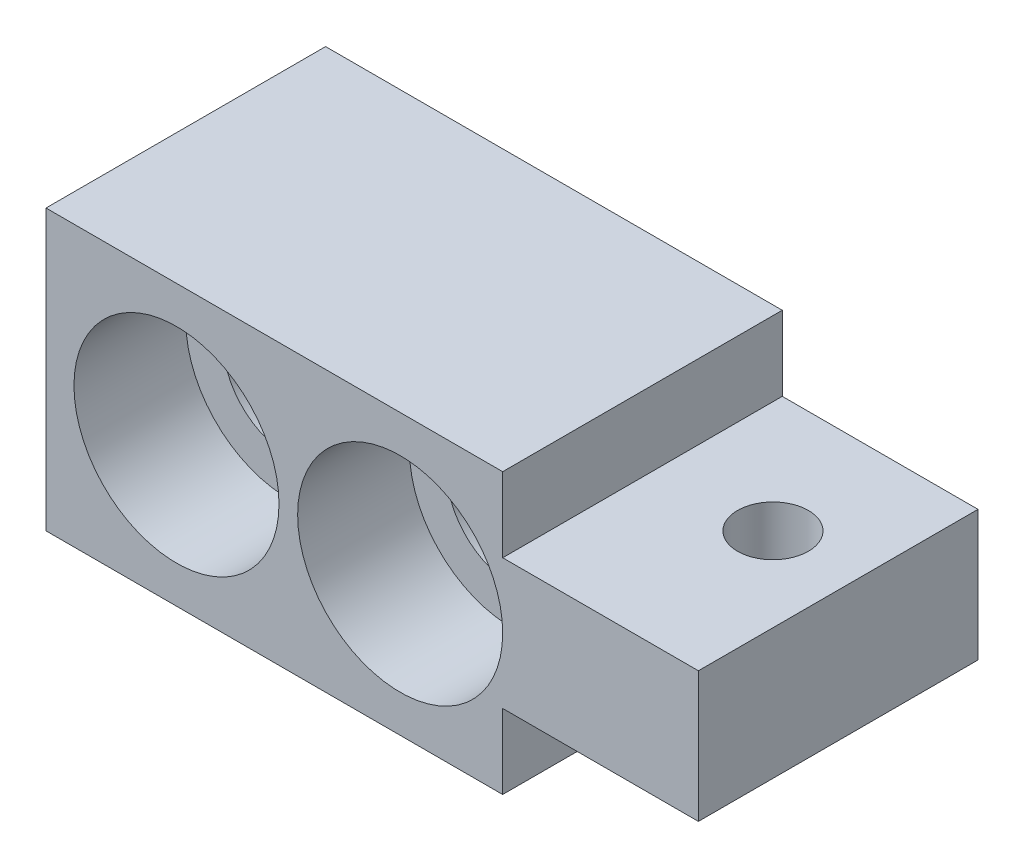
ISO-10303-21;
HEADER;
FILE_DESCRIPTION(('STEP AP214'),'2;1');
FILE_NAME('part.step','',(''),(''),'','','');
FILE_SCHEMA(('AUTOMOTIVE_DESIGN { 1 0 10303 214 1 1 1 1 }'));
ENDSEC;
DATA;
#1=APPLICATION_CONTEXT('core data for automotive mechanical design processes');
#2=APPLICATION_PROTOCOL_DEFINITION('international standard','automotive_design',2000,#1);
#3=PRODUCT_CONTEXT('',#1,'mechanical');
#4=PRODUCT('Part','Part','',(#3));
#5=PRODUCT_RELATED_PRODUCT_CATEGORY('part','',(#4));
#6=PRODUCT_DEFINITION_FORMATION('','',#4);
#7=PRODUCT_DEFINITION_CONTEXT('part definition',#1,'design');
#8=PRODUCT_DEFINITION('design','',#6,#7);
#9=PRODUCT_DEFINITION_SHAPE('','',#8);
#10=(LENGTH_UNIT() NAMED_UNIT(*) SI_UNIT(.MILLI.,.METRE.));
#11=(NAMED_UNIT(*) PLANE_ANGLE_UNIT() SI_UNIT($,.RADIAN.));
#12=(NAMED_UNIT(*) SI_UNIT($,.STERADIAN.) SOLID_ANGLE_UNIT());
#13=UNCERTAINTY_MEASURE_WITH_UNIT(LENGTH_MEASURE(1.E-05),#10,'distance_accuracy_value','');
#14=(GEOMETRIC_REPRESENTATION_CONTEXT(3) GLOBAL_UNCERTAINTY_ASSIGNED_CONTEXT((#13)) GLOBAL_UNIT_ASSIGNED_CONTEXT((#10,
#11,#12)) REPRESENTATION_CONTEXT('',''));
#15=CARTESIAN_POINT('',(0.,0.,0.));
#16=DIRECTION('',(0.,0.,1.));
#17=DIRECTION('',(1.,0.,0.));
#18=AXIS2_PLACEMENT_3D('',#15,#16,#17);
#19=CARTESIAN_POINT('',(28.,7.5,15.));
#20=DIRECTION('',(0.,0.,-1.));
#21=DIRECTION('',(1.,0.,0.));
#22=AXIS2_PLACEMENT_3D('',#19,#20,#21);
#23=PLANE('',#22);
#24=CARTESIAN_POINT('',(0.,0.,15.));
#25=DIRECTION('',(0.,0.,1.));
#26=DIRECTION('',(-1.,0.,0.));
#27=AXIS2_PLACEMENT_3D('',#24,#25,#26);
#28=CIRCLE('',#27,5.5);
#29=CARTESIAN_POINT('',(-5.5,0.,15.));
#30=VERTEX_POINT('',#29);
#31=EDGE_CURVE('E157',#30,#30,#28,.T.);
#32=ORIENTED_EDGE('',*,*,#31,.F.);
#33=EDGE_LOOP('',(#32));
#34=FACE_BOUND('',#33,.T.);
#35=DIRECTION('',(0.,1.,0.));
#36=VECTOR('',#35,1.);
#37=CARTESIAN_POINT('',(17.5,3.5,15.));
#38=LINE('',#37,#36);
#39=CARTESIAN_POINT('',(17.5,3.5,15.));
#40=VERTEX_POINT('',#39);
#41=CARTESIAN_POINT('',(17.5,7.5,15.));
#42=VERTEX_POINT('',#41);
#43=EDGE_CURVE('E88',#40,#42,#38,.T.);
#44=ORIENTED_EDGE('',*,*,#43,.T.);
#45=DIRECTION('',(-1.,0.,0.));
#46=VECTOR('',#45,1.);
#47=CARTESIAN_POINT('',(28.,7.5,15.));
#48=LINE('',#47,#46);
#49=CARTESIAN_POINT('',(-7.,7.5,15.));
#50=VERTEX_POINT('',#49);
#51=EDGE_CURVE('E22',#42,#50,#48,.T.);
#52=ORIENTED_EDGE('',*,*,#51,.T.);
#53=DIRECTION('',(0.,-1.,0.));
#54=VECTOR('',#53,1.);
#55=CARTESIAN_POINT('',(-7.,7.5,15.));
#56=LINE('',#55,#54);
#57=CARTESIAN_POINT('',(-7.,-7.5,15.));
#58=VERTEX_POINT('',#57);
#59=EDGE_CURVE('E129',#50,#58,#56,.T.);
#60=ORIENTED_EDGE('',*,*,#59,.T.);
#61=DIRECTION('',(-1.,0.,0.));
#62=VECTOR('',#61,1.);
#63=CARTESIAN_POINT('',(28.,-7.5,15.));
#64=LINE('',#63,#62);
#65=CARTESIAN_POINT('',(17.5,-7.5,15.));
#66=VERTEX_POINT('',#65);
#67=EDGE_CURVE('E140',#66,#58,#64,.T.);
#68=ORIENTED_EDGE('',*,*,#67,.F.);
#69=DIRECTION('',(0.,-1.,0.));
#70=VECTOR('',#69,1.);
#71=CARTESIAN_POINT('',(17.5,-3.5,15.));
#72=LINE('',#71,#70);
#73=CARTESIAN_POINT('',(17.5,-3.5,15.));
#74=VERTEX_POINT('',#73);
#75=EDGE_CURVE('E108',#74,#66,#72,.T.);
#76=ORIENTED_EDGE('',*,*,#75,.F.);
#77=DIRECTION('',(1.,0.,0.));
#78=VECTOR('',#77,1.);
#79=CARTESIAN_POINT('',(17.5,-3.5,15.));
#80=LINE('',#79,#78);
#81=CARTESIAN_POINT('',(28.,-3.5,15.));
#82=VERTEX_POINT('',#81);
#83=EDGE_CURVE('E110',#74,#82,#80,.T.);
#84=ORIENTED_EDGE('',*,*,#83,.T.);
#85=DIRECTION('',(0.,-1.,0.));
#86=VECTOR('',#85,1.);
#87=CARTESIAN_POINT('',(28.,7.5,15.));
#88=LINE('',#87,#86);
#89=CARTESIAN_POINT('',(28.,3.5,15.));
#90=VERTEX_POINT('',#89);
#91=EDGE_CURVE('E99',#90,#82,#88,.T.);
#92=ORIENTED_EDGE('',*,*,#91,.F.);
#93=DIRECTION('',(1.,0.,0.));
#94=VECTOR('',#93,1.);
#95=CARTESIAN_POINT('',(17.5,3.5,15.));
#96=LINE('',#95,#94);
#97=EDGE_CURVE('E82',#40,#90,#96,.T.);
#98=ORIENTED_EDGE('',*,*,#97,.F.);
#99=EDGE_LOOP('',(#44,#52,#60,#68,#76,#84,#92,#98));
#100=FACE_BOUND('',#99,.T.);
#101=CARTESIAN_POINT('',(12.,0.,15.));
#102=DIRECTION('',(0.,0.,1.));
#103=DIRECTION('',(-1.,0.,0.));
#104=AXIS2_PLACEMENT_3D('',#101,#102,#103);
#105=CIRCLE('',#104,5.5);
#106=CARTESIAN_POINT('',(6.5,0.,15.));
#107=VERTEX_POINT('',#106);
#108=EDGE_CURVE('E168',#107,#107,#105,.T.);
#109=ORIENTED_EDGE('',*,*,#108,.F.);
#110=EDGE_LOOP('',(#109));
#111=FACE_BOUND('',#110,.T.);
#112=ADVANCED_FACE('F14',(#34,#100,#111),#23,.F.);
#113=CARTESIAN_POINT('',(28.,-7.5,0.));
#114=DIRECTION('',(0.,0.,1.));
#115=DIRECTION('',(0.,1.,0.));
#116=AXIS2_PLACEMENT_3D('',#113,#114,#115);
#117=PLANE('',#116);
#118=CARTESIAN_POINT('',(0.,0.,0.));
#119=DIRECTION('',(0.,0.,1.));
#120=DIRECTION('',(0.,1.,0.));
#121=AXIS2_PLACEMENT_3D('',#118,#119,#120);
#122=CIRCLE('',#121,3.5);
#123=CARTESIAN_POINT('',(0.,3.5,0.));
#124=VERTEX_POINT('',#123);
#125=EDGE_CURVE('E145',#124,#124,#122,.F.);
#126=ORIENTED_EDGE('',*,*,#125,.F.);
#127=EDGE_LOOP('',(#126));
#128=FACE_BOUND('',#127,.T.);
#129=DIRECTION('',(0.,1.,0.));
#130=VECTOR('',#129,1.);
#131=CARTESIAN_POINT('',(17.5,3.5,0.));
#132=LINE('',#131,#130);
#133=CARTESIAN_POINT('',(17.5,3.5,0.));
#134=VERTEX_POINT('',#133);
#135=CARTESIAN_POINT('',(17.5,7.5,0.));
#136=VERTEX_POINT('',#135);
#137=EDGE_CURVE('E100',#134,#136,#132,.T.);
#138=ORIENTED_EDGE('',*,*,#137,.F.);
#139=DIRECTION('',(1.,0.,0.));
#140=VECTOR('',#139,1.);
#141=CARTESIAN_POINT('',(17.5,3.5,0.));
#142=LINE('',#141,#140);
#143=CARTESIAN_POINT('',(28.,3.5,0.));
#144=VERTEX_POINT('',#143);
#145=EDGE_CURVE('E83',#134,#144,#142,.T.);
#146=ORIENTED_EDGE('',*,*,#145,.T.);
#147=DIRECTION('',(0.,1.,0.));
#148=VECTOR('',#147,1.);
#149=CARTESIAN_POINT('',(28.,-7.5,0.));
#150=LINE('',#149,#148);
#151=CARTESIAN_POINT('',(28.,-3.5,0.));
#152=VERTEX_POINT('',#151);
#153=EDGE_CURVE('E132',#152,#144,#150,.T.);
#154=ORIENTED_EDGE('',*,*,#153,.F.);
#155=DIRECTION('',(1.,0.,0.));
#156=VECTOR('',#155,1.);
#157=CARTESIAN_POINT('',(17.5,-3.5,0.));
#158=LINE('',#157,#156);
#159=CARTESIAN_POINT('',(17.5,-3.5,0.));
#160=VERTEX_POINT('',#159);
#161=EDGE_CURVE('E38',#160,#152,#158,.T.);
#162=ORIENTED_EDGE('',*,*,#161,.F.);
#163=DIRECTION('',(0.,-1.,0.));
#164=VECTOR('',#163,1.);
#165=CARTESIAN_POINT('',(17.5,-3.5,0.));
#166=LINE('',#165,#164);
#167=CARTESIAN_POINT('',(17.5,-7.5,0.));
#168=VERTEX_POINT('',#167);
#169=EDGE_CURVE('E112',#160,#168,#166,.T.);
#170=ORIENTED_EDGE('',*,*,#169,.T.);
#171=DIRECTION('',(-1.,0.,0.));
#172=VECTOR('',#171,1.);
#173=CARTESIAN_POINT('',(28.,-7.5,0.));
#174=LINE('',#173,#172);
#175=CARTESIAN_POINT('',(-7.,-7.5,0.));
#176=VERTEX_POINT('',#175);
#177=EDGE_CURVE('E138',#168,#176,#174,.T.);
#178=ORIENTED_EDGE('',*,*,#177,.T.);
#179=DIRECTION('',(0.,1.,0.));
#180=VECTOR('',#179,1.);
#181=CARTESIAN_POINT('',(-7.,-7.5,0.));
#182=LINE('',#181,#180);
#183=CARTESIAN_POINT('',(-7.,7.5,0.));
#184=VERTEX_POINT('',#183);
#185=EDGE_CURVE('E123',#176,#184,#182,.T.);
#186=ORIENTED_EDGE('',*,*,#185,.T.);
#187=DIRECTION('',(-1.,0.,0.));
#188=VECTOR('',#187,1.);
#189=CARTESIAN_POINT('',(28.,7.5,0.));
#190=LINE('',#189,#188);
#191=EDGE_CURVE('E136',#136,#184,#190,.T.);
#192=ORIENTED_EDGE('',*,*,#191,.F.);
#193=EDGE_LOOP('',(#138,#146,#154,#162,#170,#178,#186,#192));
#194=FACE_BOUND('',#193,.T.);
#195=CARTESIAN_POINT('',(12.,0.,0.));
#196=DIRECTION('',(0.,0.,1.));
#197=DIRECTION('',(0.,1.,0.));
#198=AXIS2_PLACEMENT_3D('',#195,#196,#197);
#199=CIRCLE('',#198,3.5);
#200=CARTESIAN_POINT('',(12.,3.5,0.));
#201=VERTEX_POINT('',#200);
#202=EDGE_CURVE('E17',#201,#201,#199,.F.);
#203=ORIENTED_EDGE('',*,*,#202,.F.);
#204=EDGE_LOOP('',(#203));
#205=FACE_BOUND('',#204,.T.);
#206=ADVANCED_FACE('F175',(#128,#194,#205),#117,.F.);
#207=CARTESIAN_POINT('',(28.,7.5,15.));
#208=DIRECTION('',(0.,1.,0.));
#209=DIRECTION('',(0.,0.,-1.));
#210=AXIS2_PLACEMENT_3D('',#207,#208,#209);
#211=PLANE('',#210);
#212=ORIENTED_EDGE('',*,*,#51,.F.);
#213=DIRECTION('',(0.,0.,-1.));
#214=VECTOR('',#213,1.);
#215=CARTESIAN_POINT('',(17.5,7.5,15.));
#216=LINE('',#215,#214);
#217=EDGE_CURVE('E91',#42,#136,#216,.T.);
#218=ORIENTED_EDGE('',*,*,#217,.T.);
#219=ORIENTED_EDGE('',*,*,#191,.T.);
#220=DIRECTION('',(0.,0.,-1.));
#221=VECTOR('',#220,1.);
#222=CARTESIAN_POINT('',(-7.,7.5,15.));
#223=LINE('',#222,#221);
#224=EDGE_CURVE('E120',#50,#184,#223,.T.);
#225=ORIENTED_EDGE('',*,*,#224,.F.);
#226=EDGE_LOOP('',(#212,#218,#219,#225));
#227=FACE_BOUND('',#226,.T.);
#228=ADVANCED_FACE('F182',(#227),#211,.T.);
#229=CARTESIAN_POINT('',(28.,7.5,0.));
#230=DIRECTION('',(1.,0.,0.));
#231=DIRECTION('',(0.,1.,0.));
#232=AXIS2_PLACEMENT_3D('',#229,#230,#231);
#233=PLANE('',#232);
#234=DIRECTION('',(0.,0.,-1.));
#235=VECTOR('',#234,1.);
#236=CARTESIAN_POINT('',(28.,3.5,0.));
#237=LINE('',#236,#235);
#238=EDGE_CURVE('E30',#90,#144,#237,.T.);
#239=ORIENTED_EDGE('',*,*,#238,.F.);
#240=ORIENTED_EDGE('',*,*,#91,.T.);
#241=DIRECTION('',(0.,0.,-1.));
#242=VECTOR('',#241,1.);
#243=CARTESIAN_POINT('',(28.,-3.5,0.));
#244=LINE('',#243,#242);
#245=EDGE_CURVE('E9',#82,#152,#244,.T.);
#246=ORIENTED_EDGE('',*,*,#245,.T.);
#247=ORIENTED_EDGE('',*,*,#153,.T.);
#248=EDGE_LOOP('',(#239,#240,#246,#247));
#249=FACE_BOUND('',#248,.T.);
#250=ADVANCED_FACE('F228',(#249),#233,.T.);
#251=CARTESIAN_POINT('',(28.,-7.5,0.));
#252=DIRECTION('',(0.,-1.,0.));
#253=DIRECTION('',(1.,0.,0.));
#254=AXIS2_PLACEMENT_3D('',#251,#252,#253);
#255=PLANE('',#254);
#256=DIRECTION('',(0.,0.,-1.));
#257=VECTOR('',#256,1.);
#258=CARTESIAN_POINT('',(17.5,-7.5,0.));
#259=LINE('',#258,#257);
#260=EDGE_CURVE('E118',#66,#168,#259,.T.);
#261=ORIENTED_EDGE('',*,*,#260,.F.);
#262=ORIENTED_EDGE('',*,*,#67,.T.);
#263=DIRECTION('',(0.,0.,1.));
#264=VECTOR('',#263,1.);
#265=CARTESIAN_POINT('',(-7.,-7.5,0.));
#266=LINE('',#265,#264);
#267=EDGE_CURVE('E126',#176,#58,#266,.T.);
#268=ORIENTED_EDGE('',*,*,#267,.F.);
#269=ORIENTED_EDGE('',*,*,#177,.F.);
#270=EDGE_LOOP('',(#261,#262,#268,#269));
#271=FACE_BOUND('',#270,.T.);
#272=ADVANCED_FACE('F226',(#271),#255,.T.);
#273=CARTESIAN_POINT('',(-7.,7.5,0.));
#274=DIRECTION('',(1.,0.,0.));
#275=DIRECTION('',(0.,1.,0.));
#276=AXIS2_PLACEMENT_3D('',#273,#274,#275);
#277=PLANE('',#276);
#278=ORIENTED_EDGE('',*,*,#224,.T.);
#279=ORIENTED_EDGE('',*,*,#185,.F.);
#280=ORIENTED_EDGE('',*,*,#267,.T.);
#281=ORIENTED_EDGE('',*,*,#59,.F.);
#282=EDGE_LOOP('',(#278,#279,#280,#281));
#283=FACE_BOUND('',#282,.T.);
#284=ADVANCED_FACE('F222',(#283),#277,.F.);
#285=CARTESIAN_POINT('',(17.5,-3.5,0.));
#286=DIRECTION('',(-1.,0.,0.));
#287=DIRECTION('',(0.,-1.,0.));
#288=AXIS2_PLACEMENT_3D('',#285,#286,#287);
#289=PLANE('',#288);
#290=ORIENTED_EDGE('',*,*,#260,.T.);
#291=ORIENTED_EDGE('',*,*,#169,.F.);
#292=DIRECTION('',(0.,0.,1.));
#293=VECTOR('',#292,1.);
#294=CARTESIAN_POINT('',(17.5,-3.5,0.));
#295=LINE('',#294,#293);
#296=EDGE_CURVE('E116',#160,#74,#295,.T.);
#297=ORIENTED_EDGE('',*,*,#296,.T.);
#298=ORIENTED_EDGE('',*,*,#75,.T.);
#299=EDGE_LOOP('',(#290,#291,#297,#298));
#300=FACE_BOUND('',#299,.T.);
#301=ADVANCED_FACE('F218',(#300),#289,.F.);
#302=CARTESIAN_POINT('',(17.5,-3.5,0.));
#303=DIRECTION('',(0.,-1.,0.));
#304=DIRECTION('',(1.,0.,0.));
#305=AXIS2_PLACEMENT_3D('',#302,#303,#304);
#306=PLANE('',#305);
#307=CARTESIAN_POINT('',(23.5,-3.5,6.5));
#308=DIRECTION('',(0.,-1.,0.));
#309=DIRECTION('',(1.,0.,0.));
#310=AXIS2_PLACEMENT_3D('',#307,#308,#309);
#311=CIRCLE('',#310,1.9);
#312=CARTESIAN_POINT('',(25.4,-3.5,6.5));
#313=VERTEX_POINT('',#312);
#314=EDGE_CURVE('E144',#313,#313,#311,.T.);
#315=ORIENTED_EDGE('',*,*,#314,.F.);
#316=EDGE_LOOP('',(#315));
#317=FACE_BOUND('',#316,.T.);
#318=ORIENTED_EDGE('',*,*,#83,.F.);
#319=ORIENTED_EDGE('',*,*,#296,.F.);
#320=ORIENTED_EDGE('',*,*,#161,.T.);
#321=ORIENTED_EDGE('',*,*,#245,.F.);
#322=EDGE_LOOP('',(#318,#319,#320,#321));
#323=FACE_BOUND('',#322,.T.);
#324=ADVANCED_FACE('F212',(#317,#323),#306,.T.);
#325=CARTESIAN_POINT('',(17.5,3.5,0.));
#326=DIRECTION('',(1.,0.,0.));
#327=DIRECTION('',(0.,1.,0.));
#328=AXIS2_PLACEMENT_3D('',#325,#326,#327);
#329=PLANE('',#328);
#330=ORIENTED_EDGE('',*,*,#43,.F.);
#331=DIRECTION('',(0.,0.,1.));
#332=VECTOR('',#331,1.);
#333=CARTESIAN_POINT('',(17.5,3.5,0.));
#334=LINE('',#333,#332);
#335=EDGE_CURVE('E78',#134,#40,#334,.T.);
#336=ORIENTED_EDGE('',*,*,#335,.F.);
#337=ORIENTED_EDGE('',*,*,#137,.T.);
#338=ORIENTED_EDGE('',*,*,#217,.F.);
#339=EDGE_LOOP('',(#330,#336,#337,#338));
#340=FACE_BOUND('',#339,.T.);
#341=ADVANCED_FACE('F89',(#340),#329,.T.);
#342=CARTESIAN_POINT('',(17.5,3.5,0.));
#343=DIRECTION('',(0.,-1.,0.));
#344=DIRECTION('',(1.,0.,0.));
#345=AXIS2_PLACEMENT_3D('',#342,#343,#344);
#346=PLANE('',#345);
#347=CARTESIAN_POINT('',(23.5,3.5,6.5));
#348=DIRECTION('',(0.,-1.,0.));
#349=DIRECTION('',(1.,0.,0.));
#350=AXIS2_PLACEMENT_3D('',#347,#348,#349);
#351=CIRCLE('',#350,1.9);
#352=CARTESIAN_POINT('',(25.4,3.5,6.5));
#353=VERTEX_POINT('',#352);
#354=EDGE_CURVE('E94',#353,#353,#351,.T.);
#355=ORIENTED_EDGE('',*,*,#354,.T.);
#356=EDGE_LOOP('',(#355));
#357=FACE_BOUND('',#356,.T.);
#358=ORIENTED_EDGE('',*,*,#238,.T.);
#359=ORIENTED_EDGE('',*,*,#145,.F.);
#360=ORIENTED_EDGE('',*,*,#335,.T.);
#361=ORIENTED_EDGE('',*,*,#97,.T.);
#362=EDGE_LOOP('',(#358,#359,#360,#361));
#363=FACE_BOUND('',#362,.T.);
#364=ADVANCED_FACE('F80',(#357,#363),#346,.F.);
#365=CARTESIAN_POINT('',(23.5,7.5,6.5));
#366=DIRECTION('',(0.,-1.,0.));
#367=DIRECTION('',(1.,0.,0.));
#368=AXIS2_PLACEMENT_3D('',#365,#366,#367);
#369=CYLINDRICAL_SURFACE('',#368,1.9);
#370=ORIENTED_EDGE('',*,*,#314,.T.);
#371=EDGE_LOOP('',(#370));
#372=FACE_BOUND('',#371,.T.);
#373=ORIENTED_EDGE('',*,*,#354,.F.);
#374=EDGE_LOOP('',(#373));
#375=FACE_BOUND('',#374,.T.);
#376=ADVANCED_FACE('F203',(#372,#375),#369,.F.);
#377=CARTESIAN_POINT('',(0.,0.,15.));
#378=DIRECTION('',(0.,0.,1.));
#379=DIRECTION('',(-1.,0.,0.));
#380=AXIS2_PLACEMENT_3D('',#377,#378,#379);
#381=CYLINDRICAL_SURFACE('',#380,3.5);
#382=CARTESIAN_POINT('',(0.,0.,9.));
#383=DIRECTION('',(0.,0.,1.));
#384=DIRECTION('',(-1.,0.,0.));
#385=AXIS2_PLACEMENT_3D('',#382,#383,#384);
#386=CIRCLE('',#385,3.5);
#387=CARTESIAN_POINT('',(-3.5,0.,9.));
#388=VERTEX_POINT('',#387);
#389=EDGE_CURVE('E147',#388,#388,#386,.T.);
#390=ORIENTED_EDGE('',*,*,#389,.T.);
#391=EDGE_LOOP('',(#390));
#392=FACE_BOUND('',#391,.T.);
#393=ORIENTED_EDGE('',*,*,#125,.T.);
#394=EDGE_LOOP('',(#393));
#395=FACE_BOUND('',#394,.T.);
#396=ADVANCED_FACE('F197',(#392,#395),#381,.F.);
#397=CARTESIAN_POINT('',(0.,-3.5,9.));
#398=DIRECTION('',(0.,0.,1.));
#399=DIRECTION('',(-1.,0.,0.));
#400=AXIS2_PLACEMENT_3D('',#397,#398,#399);
#401=PLANE('',#400);
#402=CARTESIAN_POINT('',(0.,0.,9.));
#403=DIRECTION('',(0.,0.,1.));
#404=DIRECTION('',(-1.,0.,0.));
#405=AXIS2_PLACEMENT_3D('',#402,#403,#404);
#406=CIRCLE('',#405,5.5);
#407=CARTESIAN_POINT('',(-5.5,0.,9.));
#408=VERTEX_POINT('',#407);
#409=EDGE_CURVE('E152',#408,#408,#406,.T.);
#410=ORIENTED_EDGE('',*,*,#409,.T.);
#411=EDGE_LOOP('',(#410));
#412=FACE_BOUND('',#411,.T.);
#413=ORIENTED_EDGE('',*,*,#389,.F.);
#414=EDGE_LOOP('',(#413));
#415=FACE_BOUND('',#414,.T.);
#416=ADVANCED_FACE('F191',(#412,#415),#401,.T.);
#417=CARTESIAN_POINT('',(0.,0.,15.));
#418=DIRECTION('',(0.,0.,1.));
#419=DIRECTION('',(-1.,0.,0.));
#420=AXIS2_PLACEMENT_3D('',#417,#418,#419);
#421=CYLINDRICAL_SURFACE('',#420,5.5);
#422=ORIENTED_EDGE('',*,*,#31,.T.);
#423=EDGE_LOOP('',(#422));
#424=FACE_BOUND('',#423,.T.);
#425=ORIENTED_EDGE('',*,*,#409,.F.);
#426=EDGE_LOOP('',(#425));
#427=FACE_BOUND('',#426,.T.);
#428=ADVANCED_FACE('F187',(#424,#427),#421,.F.);
#429=CARTESIAN_POINT('',(12.,0.,15.));
#430=DIRECTION('',(0.,0.,1.));
#431=DIRECTION('',(-1.,0.,0.));
#432=AXIS2_PLACEMENT_3D('',#429,#430,#431);
#433=CYLINDRICAL_SURFACE('',#432,3.5);
#434=CARTESIAN_POINT('',(12.,0.,9.));
#435=DIRECTION('',(0.,0.,1.));
#436=DIRECTION('',(-1.,0.,0.));
#437=AXIS2_PLACEMENT_3D('',#434,#435,#436);
#438=CIRCLE('',#437,3.5);
#439=CARTESIAN_POINT('',(8.5,0.,9.));
#440=VERTEX_POINT('',#439);
#441=EDGE_CURVE('E162',#440,#440,#438,.T.);
#442=ORIENTED_EDGE('',*,*,#441,.T.);
#443=EDGE_LOOP('',(#442));
#444=FACE_BOUND('',#443,.T.);
#445=ORIENTED_EDGE('',*,*,#202,.T.);
#446=EDGE_LOOP('',(#445));
#447=FACE_BOUND('',#446,.T.);
#448=ADVANCED_FACE('F190',(#444,#447),#433,.F.);
#449=CARTESIAN_POINT('',(12.,-3.5,9.));
#450=DIRECTION('',(0.,0.,1.));
#451=DIRECTION('',(-1.,0.,0.));
#452=AXIS2_PLACEMENT_3D('',#449,#450,#451);
#453=PLANE('',#452);
#454=CARTESIAN_POINT('',(12.,0.,9.));
#455=DIRECTION('',(0.,0.,1.));
#456=DIRECTION('',(-1.,0.,0.));
#457=AXIS2_PLACEMENT_3D('',#454,#455,#456);
#458=CIRCLE('',#457,5.5);
#459=CARTESIAN_POINT('',(6.5,0.,9.));
#460=VERTEX_POINT('',#459);
#461=EDGE_CURVE('E165',#460,#460,#458,.T.);
#462=ORIENTED_EDGE('',*,*,#461,.T.);
#463=EDGE_LOOP('',(#462));
#464=FACE_BOUND('',#463,.T.);
#465=ORIENTED_EDGE('',*,*,#441,.F.);
#466=EDGE_LOOP('',(#465));
#467=FACE_BOUND('',#466,.T.);
#468=ADVANCED_FACE('F257',(#464,#467),#453,.T.);
#469=CARTESIAN_POINT('',(12.,0.,15.));
#470=DIRECTION('',(0.,0.,1.));
#471=DIRECTION('',(-1.,0.,0.));
#472=AXIS2_PLACEMENT_3D('',#469,#470,#471);
#473=CYLINDRICAL_SURFACE('',#472,5.5);
#474=ORIENTED_EDGE('',*,*,#108,.T.);
#475=EDGE_LOOP('',(#474));
#476=FACE_BOUND('',#475,.T.);
#477=ORIENTED_EDGE('',*,*,#461,.F.);
#478=EDGE_LOOP('',(#477));
#479=FACE_BOUND('',#478,.T.);
#480=ADVANCED_FACE('F172',(#476,#479),#473,.F.);
#481=CLOSED_SHELL('',(#112,#206,#228,#250,#272,#284,#301,#324,#341,#364,#376,#396,#416,#428,
#448,#468,#480));
#482=MANIFOLD_SOLID_BREP('B1',#481);
#483=ADVANCED_BREP_SHAPE_REPRESENTATION('',(#18,#482),#14);
#484=SHAPE_DEFINITION_REPRESENTATION(#9,#483);
ENDSEC;
END-ISO-10303-21;
